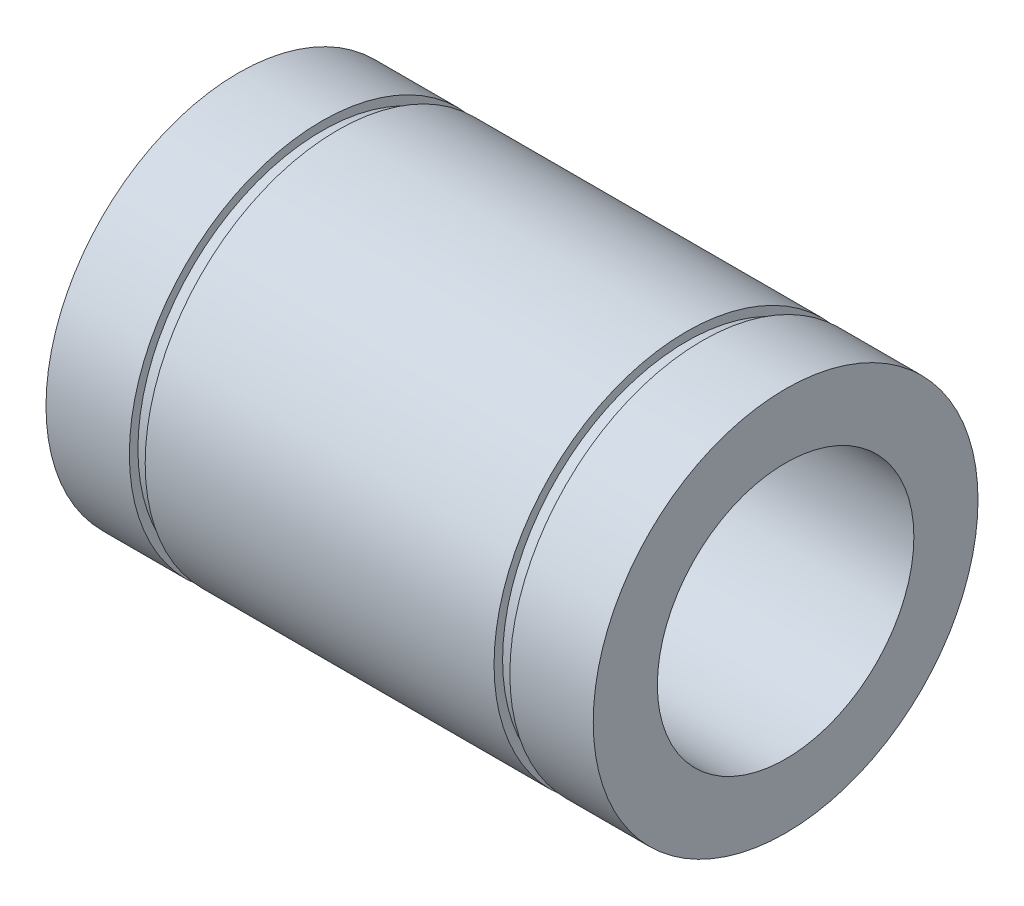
ISO-10303-21;
HEADER;
FILE_DESCRIPTION(('STEP AP214'),'2;1');
FILE_NAME('part.step','',(''),(''),'','','');
FILE_SCHEMA(('AUTOMOTIVE_DESIGN { 1 0 10303 214 1 1 1 1 }'));
ENDSEC;
DATA;
#1=APPLICATION_CONTEXT('core data for automotive mechanical design processes');
#2=APPLICATION_PROTOCOL_DEFINITION('international standard','automotive_design',2000,#1);
#3=PRODUCT_CONTEXT('',#1,'mechanical');
#4=PRODUCT('Part','Part','',(#3));
#5=PRODUCT_RELATED_PRODUCT_CATEGORY('part','',(#4));
#6=PRODUCT_DEFINITION_FORMATION('','',#4);
#7=PRODUCT_DEFINITION_CONTEXT('part definition',#1,'design');
#8=PRODUCT_DEFINITION('design','',#6,#7);
#9=PRODUCT_DEFINITION_SHAPE('','',#8);
#10=(LENGTH_UNIT() NAMED_UNIT(*) SI_UNIT(.MILLI.,.METRE.));
#11=(NAMED_UNIT(*) PLANE_ANGLE_UNIT() SI_UNIT($,.RADIAN.));
#12=(NAMED_UNIT(*) SI_UNIT($,.STERADIAN.) SOLID_ANGLE_UNIT());
#13=UNCERTAINTY_MEASURE_WITH_UNIT(LENGTH_MEASURE(1.E-05),#10,'distance_accuracy_value','');
#14=(GEOMETRIC_REPRESENTATION_CONTEXT(3) GLOBAL_UNCERTAINTY_ASSIGNED_CONTEXT((#13)) GLOBAL_UNIT_ASSIGNED_CONTEXT((#10,
#11,#12)) REPRESENTATION_CONTEXT('',''));
#15=CARTESIAN_POINT('',(0.,0.,0.));
#16=DIRECTION('',(0.,0.,1.));
#17=DIRECTION('',(1.,0.,0.));
#18=AXIS2_PLACEMENT_3D('',#15,#16,#17);
#19=CARTESIAN_POINT('',(32.,0.,0.));
#20=DIRECTION('',(-1.,0.,0.));
#21=DIRECTION('',(0.,0.,-1.));
#22=AXIS2_PLACEMENT_3D('',#19,#20,#21);
#23=CYLINDRICAL_SURFACE('',#22,22.5);
#24=CARTESIAN_POINT('',(-32.,0.,0.));
#25=DIRECTION('',(1.,0.,0.));
#26=DIRECTION('',(0.,0.,-1.));
#27=AXIS2_PLACEMENT_3D('',#24,#25,#26);
#28=CIRCLE('',#27,22.5);
#29=CARTESIAN_POINT('',(-32.,0.,-22.5));
#30=VERTEX_POINT('',#29);
#31=CARTESIAN_POINT('',(-32.,0.,22.5));
#32=VERTEX_POINT('',#31);
#33=EDGE_CURVE('E132',#30,#32,#28,.T.);
#34=ORIENTED_EDGE('',*,*,#33,.T.);
#35=DIRECTION('',(1.,0.,0.));
#36=VECTOR('',#35,1.);
#37=CARTESIAN_POINT('',(32.,0.,22.5));
#38=LINE('',#37,#36);
#39=CARTESIAN_POINT('',(-22.25,0.,22.5));
#40=VERTEX_POINT('',#39);
#41=EDGE_CURVE('E10',#32,#40,#38,.T.);
#42=ORIENTED_EDGE('',*,*,#41,.T.);
#43=CARTESIAN_POINT('',(-22.25,0.,0.));
#44=DIRECTION('',(1.,0.,0.));
#45=DIRECTION('',(0.,0.,-1.));
#46=AXIS2_PLACEMENT_3D('',#43,#44,#45);
#47=CIRCLE('',#46,22.5);
#48=CARTESIAN_POINT('',(-22.25,0.,-22.5));
#49=VERTEX_POINT('',#48);
#50=EDGE_CURVE('E228',#49,#40,#47,.T.);
#51=ORIENTED_EDGE('',*,*,#50,.F.);
#52=CARTESIAN_POINT('',(-22.25,0.,0.));
#53=DIRECTION('',(1.,0.,0.));
#54=DIRECTION('',(0.,0.,-1.));
#55=AXIS2_PLACEMENT_3D('',#52,#53,#54);
#56=CIRCLE('',#55,22.5);
#57=EDGE_CURVE('E24',#40,#49,#56,.T.);
#58=ORIENTED_EDGE('',*,*,#57,.F.);
#59=ORIENTED_EDGE('',*,*,#41,.F.);
#60=CARTESIAN_POINT('',(-32.,0.,0.));
#61=DIRECTION('',(1.,0.,0.));
#62=DIRECTION('',(0.,0.,-1.));
#63=AXIS2_PLACEMENT_3D('',#60,#61,#62);
#64=CIRCLE('',#63,22.5);
#65=EDGE_CURVE('E130',#32,#30,#64,.T.);
#66=ORIENTED_EDGE('',*,*,#65,.T.);
#67=EDGE_LOOP('',(#34,#42,#51,#58,#59,#66));
#68=FACE_BOUND('',#67,.T.);
#69=ADVANCED_FACE('F16',(#68),#23,.T.);
#70=CARTESIAN_POINT('',(-22.25,21.5,0.));
#71=DIRECTION('',(1.,0.,0.));
#72=DIRECTION('',(0.,1.,0.));
#73=AXIS2_PLACEMENT_3D('',#70,#71,#72);
#74=PLANE('',#73);
#75=CARTESIAN_POINT('',(-22.25,0.,0.));
#76=DIRECTION('',(1.,0.,0.));
#77=DIRECTION('',(0.,0.,-1.));
#78=AXIS2_PLACEMENT_3D('',#75,#76,#77);
#79=CIRCLE('',#78,21.5);
#80=CARTESIAN_POINT('',(-22.25,0.,-21.5));
#81=VERTEX_POINT('',#80);
#82=CARTESIAN_POINT('',(-22.25,0.,21.5));
#83=VERTEX_POINT('',#82);
#84=EDGE_CURVE('E173',#81,#83,#79,.T.);
#85=ORIENTED_EDGE('',*,*,#84,.F.);
#86=CARTESIAN_POINT('',(-22.25,0.,0.));
#87=DIRECTION('',(1.,0.,0.));
#88=DIRECTION('',(0.,0.,-1.));
#89=AXIS2_PLACEMENT_3D('',#86,#87,#88);
#90=CIRCLE('',#89,21.5);
#91=EDGE_CURVE('E225',#83,#81,#90,.T.);
#92=ORIENTED_EDGE('',*,*,#91,.F.);
#93=EDGE_LOOP('',(#85,#92));
#94=FACE_BOUND('',#93,.T.);
#95=ORIENTED_EDGE('',*,*,#50,.T.);
#96=ORIENTED_EDGE('',*,*,#57,.T.);
#97=EDGE_LOOP('',(#95,#96));
#98=FACE_BOUND('',#97,.T.);
#99=ADVANCED_FACE('F327',(#94,#98),#74,.T.);
#100=CARTESIAN_POINT('',(32.,0.,0.));
#101=DIRECTION('',(-1.,0.,0.));
#102=DIRECTION('',(0.,0.,-1.));
#103=AXIS2_PLACEMENT_3D('',#100,#101,#102);
#104=CYLINDRICAL_SURFACE('',#103,21.5);
#105=ORIENTED_EDGE('',*,*,#84,.T.);
#106=DIRECTION('',(1.,0.,0.));
#107=VECTOR('',#106,1.);
#108=CARTESIAN_POINT('',(32.,0.,21.5));
#109=LINE('',#108,#107);
#110=CARTESIAN_POINT('',(-20.4,0.,21.5));
#111=VERTEX_POINT('',#110);
#112=EDGE_CURVE('E222',#83,#111,#109,.T.);
#113=ORIENTED_EDGE('',*,*,#112,.T.);
#114=CARTESIAN_POINT('',(-20.4,0.,0.));
#115=DIRECTION('',(1.,0.,0.));
#116=DIRECTION('',(0.,0.,-1.));
#117=AXIS2_PLACEMENT_3D('',#114,#115,#116);
#118=CIRCLE('',#117,21.5);
#119=CARTESIAN_POINT('',(-20.4,0.,-21.5));
#120=VERTEX_POINT('',#119);
#121=EDGE_CURVE('E157',#120,#111,#118,.T.);
#122=ORIENTED_EDGE('',*,*,#121,.F.);
#123=CARTESIAN_POINT('',(-20.4,0.,0.));
#124=DIRECTION('',(1.,0.,0.));
#125=DIRECTION('',(0.,0.,-1.));
#126=AXIS2_PLACEMENT_3D('',#123,#124,#125);
#127=CIRCLE('',#126,21.5);
#128=EDGE_CURVE('E161',#111,#120,#127,.T.);
#129=ORIENTED_EDGE('',*,*,#128,.F.);
#130=ORIENTED_EDGE('',*,*,#112,.F.);
#131=ORIENTED_EDGE('',*,*,#91,.T.);
#132=EDGE_LOOP('',(#105,#113,#122,#129,#130,#131));
#133=FACE_BOUND('',#132,.T.);
#134=ADVANCED_FACE('F334',(#133),#104,.T.);
#135=CARTESIAN_POINT('',(-20.4,22.5,0.));
#136=DIRECTION('',(-1.,0.,0.));
#137=DIRECTION('',(0.,0.,1.));
#138=AXIS2_PLACEMENT_3D('',#135,#136,#137);
#139=PLANE('',#138);
#140=ORIENTED_EDGE('',*,*,#121,.T.);
#141=ORIENTED_EDGE('',*,*,#128,.T.);
#142=EDGE_LOOP('',(#140,#141));
#143=FACE_BOUND('',#142,.T.);
#144=CARTESIAN_POINT('',(-20.4,0.,0.));
#145=DIRECTION('',(1.,0.,0.));
#146=DIRECTION('',(0.,0.,-1.));
#147=AXIS2_PLACEMENT_3D('',#144,#145,#146);
#148=CIRCLE('',#147,22.5);
#149=CARTESIAN_POINT('',(-20.4,0.,-22.5));
#150=VERTEX_POINT('',#149);
#151=CARTESIAN_POINT('',(-20.4,0.,22.5));
#152=VERTEX_POINT('',#151);
#153=EDGE_CURVE('E210',#150,#152,#148,.T.);
#154=ORIENTED_EDGE('',*,*,#153,.F.);
#155=CARTESIAN_POINT('',(-20.4,0.,0.));
#156=DIRECTION('',(1.,0.,0.));
#157=DIRECTION('',(0.,0.,-1.));
#158=AXIS2_PLACEMENT_3D('',#155,#156,#157);
#159=CIRCLE('',#158,22.5);
#160=EDGE_CURVE('E162',#152,#150,#159,.T.);
#161=ORIENTED_EDGE('',*,*,#160,.F.);
#162=EDGE_LOOP('',(#154,#161));
#163=FACE_BOUND('',#162,.T.);
#164=ADVANCED_FACE('F344',(#143,#163),#139,.T.);
#165=CARTESIAN_POINT('',(32.,0.,0.));
#166=DIRECTION('',(-1.,0.,0.));
#167=DIRECTION('',(0.,0.,-1.));
#168=AXIS2_PLACEMENT_3D('',#165,#166,#167);
#169=CYLINDRICAL_SURFACE('',#168,22.5);
#170=ORIENTED_EDGE('',*,*,#153,.T.);
#171=DIRECTION('',(1.,0.,0.));
#172=VECTOR('',#171,1.);
#173=CARTESIAN_POINT('',(32.,0.,22.5));
#174=LINE('',#173,#172);
#175=CARTESIAN_POINT('',(20.4,0.,22.5));
#176=VERTEX_POINT('',#175);
#177=EDGE_CURVE('E214',#152,#176,#174,.T.);
#178=ORIENTED_EDGE('',*,*,#177,.T.);
#179=CARTESIAN_POINT('',(20.4,0.,0.));
#180=DIRECTION('',(1.,0.,0.));
#181=DIRECTION('',(0.,0.,-1.));
#182=AXIS2_PLACEMENT_3D('',#179,#180,#181);
#183=CIRCLE('',#182,22.5);
#184=CARTESIAN_POINT('',(20.4,0.,-22.5));
#185=VERTEX_POINT('',#184);
#186=EDGE_CURVE('E203',#185,#176,#183,.T.);
#187=ORIENTED_EDGE('',*,*,#186,.F.);
#188=CARTESIAN_POINT('',(20.4,0.,0.));
#189=DIRECTION('',(1.,0.,0.));
#190=DIRECTION('',(0.,0.,-1.));
#191=AXIS2_PLACEMENT_3D('',#188,#189,#190);
#192=CIRCLE('',#191,22.5);
#193=EDGE_CURVE('E207',#176,#185,#192,.T.);
#194=ORIENTED_EDGE('',*,*,#193,.F.);
#195=ORIENTED_EDGE('',*,*,#177,.F.);
#196=ORIENTED_EDGE('',*,*,#160,.T.);
#197=EDGE_LOOP('',(#170,#178,#187,#194,#195,#196));
#198=FACE_BOUND('',#197,.T.);
#199=ADVANCED_FACE('F339',(#198),#169,.T.);
#200=CARTESIAN_POINT('',(20.4,21.5,0.));
#201=DIRECTION('',(1.,0.,0.));
#202=DIRECTION('',(0.,1.,0.));
#203=AXIS2_PLACEMENT_3D('',#200,#201,#202);
#204=PLANE('',#203);
#205=CARTESIAN_POINT('',(20.4,0.,0.));
#206=DIRECTION('',(1.,0.,0.));
#207=DIRECTION('',(0.,0.,-1.));
#208=AXIS2_PLACEMENT_3D('',#205,#206,#207);
#209=CIRCLE('',#208,21.5);
#210=CARTESIAN_POINT('',(20.4,0.,-21.5));
#211=VERTEX_POINT('',#210);
#212=CARTESIAN_POINT('',(20.4,0.,21.5));
#213=VERTEX_POINT('',#212);
#214=EDGE_CURVE('E163',#211,#213,#209,.T.);
#215=ORIENTED_EDGE('',*,*,#214,.F.);
#216=CARTESIAN_POINT('',(20.4,0.,0.));
#217=DIRECTION('',(1.,0.,0.));
#218=DIRECTION('',(0.,0.,-1.));
#219=AXIS2_PLACEMENT_3D('',#216,#217,#218);
#220=CIRCLE('',#219,21.5);
#221=EDGE_CURVE('E176',#213,#211,#220,.T.);
#222=ORIENTED_EDGE('',*,*,#221,.F.);
#223=EDGE_LOOP('',(#215,#222));
#224=FACE_BOUND('',#223,.T.);
#225=ORIENTED_EDGE('',*,*,#186,.T.);
#226=ORIENTED_EDGE('',*,*,#193,.T.);
#227=EDGE_LOOP('',(#225,#226));
#228=FACE_BOUND('',#227,.T.);
#229=ADVANCED_FACE('F343',(#224,#228),#204,.T.);
#230=CARTESIAN_POINT('',(32.,0.,0.));
#231=DIRECTION('',(-1.,0.,0.));
#232=DIRECTION('',(0.,0.,-1.));
#233=AXIS2_PLACEMENT_3D('',#230,#231,#232);
#234=CYLINDRICAL_SURFACE('',#233,21.5);
#235=ORIENTED_EDGE('',*,*,#214,.T.);
#236=DIRECTION('',(1.,0.,0.));
#237=VECTOR('',#236,1.);
#238=CARTESIAN_POINT('',(32.,0.,21.5));
#239=LINE('',#238,#237);
#240=CARTESIAN_POINT('',(22.25,0.,21.5));
#241=VERTEX_POINT('',#240);
#242=EDGE_CURVE('E167',#213,#241,#239,.T.);
#243=ORIENTED_EDGE('',*,*,#242,.T.);
#244=CARTESIAN_POINT('',(22.25,0.,0.));
#245=DIRECTION('',(1.,0.,0.));
#246=DIRECTION('',(0.,0.,-1.));
#247=AXIS2_PLACEMENT_3D('',#244,#245,#246);
#248=CIRCLE('',#247,21.5);
#249=CARTESIAN_POINT('',(22.25,0.,-21.5));
#250=VERTEX_POINT('',#249);
#251=EDGE_CURVE('E195',#250,#241,#248,.T.);
#252=ORIENTED_EDGE('',*,*,#251,.F.);
#253=CARTESIAN_POINT('',(22.25,0.,0.));
#254=DIRECTION('',(1.,0.,0.));
#255=DIRECTION('',(0.,0.,-1.));
#256=AXIS2_PLACEMENT_3D('',#253,#254,#255);
#257=CIRCLE('',#256,21.5);
#258=EDGE_CURVE('E168',#241,#250,#257,.T.);
#259=ORIENTED_EDGE('',*,*,#258,.F.);
#260=ORIENTED_EDGE('',*,*,#242,.F.);
#261=ORIENTED_EDGE('',*,*,#221,.T.);
#262=EDGE_LOOP('',(#235,#243,#252,#259,#260,#261));
#263=FACE_BOUND('',#262,.T.);
#264=ADVANCED_FACE('F353',(#263),#234,.T.);
#265=CARTESIAN_POINT('',(22.25,22.5,0.));
#266=DIRECTION('',(-1.,0.,0.));
#267=DIRECTION('',(0.,0.,1.));
#268=AXIS2_PLACEMENT_3D('',#265,#266,#267);
#269=PLANE('',#268);
#270=ORIENTED_EDGE('',*,*,#251,.T.);
#271=ORIENTED_EDGE('',*,*,#258,.T.);
#272=EDGE_LOOP('',(#270,#271));
#273=FACE_BOUND('',#272,.T.);
#274=CARTESIAN_POINT('',(22.25,0.,0.));
#275=DIRECTION('',(1.,0.,0.));
#276=DIRECTION('',(0.,0.,-1.));
#277=AXIS2_PLACEMENT_3D('',#274,#275,#276);
#278=CIRCLE('',#277,22.5);
#279=CARTESIAN_POINT('',(22.25,0.,-22.5));
#280=VERTEX_POINT('',#279);
#281=CARTESIAN_POINT('',(22.25,0.,22.5));
#282=VERTEX_POINT('',#281);
#283=EDGE_CURVE('E187',#280,#282,#278,.T.);
#284=ORIENTED_EDGE('',*,*,#283,.F.);
#285=CARTESIAN_POINT('',(22.25,0.,0.));
#286=DIRECTION('',(1.,0.,0.));
#287=DIRECTION('',(0.,0.,-1.));
#288=AXIS2_PLACEMENT_3D('',#285,#286,#287);
#289=CIRCLE('',#288,22.5);
#290=EDGE_CURVE('E186',#282,#280,#289,.T.);
#291=ORIENTED_EDGE('',*,*,#290,.F.);
#292=EDGE_LOOP('',(#284,#291));
#293=FACE_BOUND('',#292,.T.);
#294=ADVANCED_FACE('F367',(#273,#293),#269,.T.);
#295=CARTESIAN_POINT('',(32.,0.,0.));
#296=DIRECTION('',(-1.,0.,0.));
#297=DIRECTION('',(0.,0.,-1.));
#298=AXIS2_PLACEMENT_3D('',#295,#296,#297);
#299=CYLINDRICAL_SURFACE('',#298,22.5);
#300=ORIENTED_EDGE('',*,*,#283,.T.);
#301=DIRECTION('',(1.,0.,0.));
#302=VECTOR('',#301,1.);
#303=CARTESIAN_POINT('',(32.,0.,22.5));
#304=LINE('',#303,#302);
#305=CARTESIAN_POINT('',(32.,0.,22.5));
#306=VERTEX_POINT('',#305);
#307=EDGE_CURVE('E183',#282,#306,#304,.T.);
#308=ORIENTED_EDGE('',*,*,#307,.T.);
#309=CARTESIAN_POINT('',(32.,0.,0.));
#310=DIRECTION('',(1.,0.,0.));
#311=DIRECTION('',(0.,0.,-1.));
#312=AXIS2_PLACEMENT_3D('',#309,#310,#311);
#313=CIRCLE('',#312,22.5);
#314=CARTESIAN_POINT('',(32.,0.,-22.5));
#315=VERTEX_POINT('',#314);
#316=EDGE_CURVE('E146',#315,#306,#313,.T.);
#317=ORIENTED_EDGE('',*,*,#316,.F.);
#318=CARTESIAN_POINT('',(32.,0.,0.));
#319=DIRECTION('',(1.,0.,0.));
#320=DIRECTION('',(0.,0.,-1.));
#321=AXIS2_PLACEMENT_3D('',#318,#319,#320);
#322=CIRCLE('',#321,22.5);
#323=EDGE_CURVE('E182',#306,#315,#322,.T.);
#324=ORIENTED_EDGE('',*,*,#323,.F.);
#325=ORIENTED_EDGE('',*,*,#307,.F.);
#326=ORIENTED_EDGE('',*,*,#290,.T.);
#327=EDGE_LOOP('',(#300,#308,#317,#324,#325,#326));
#328=FACE_BOUND('',#327,.T.);
#329=ADVANCED_FACE('F371',(#328),#299,.T.);
#330=CARTESIAN_POINT('',(32.,15.,0.));
#331=DIRECTION('',(1.,0.,0.));
#332=DIRECTION('',(0.,1.,0.));
#333=AXIS2_PLACEMENT_3D('',#330,#331,#332);
#334=PLANE('',#333);
#335=CARTESIAN_POINT('',(32.,0.,0.));
#336=DIRECTION('',(1.,0.,0.));
#337=DIRECTION('',(0.,0.,-1.));
#338=AXIS2_PLACEMENT_3D('',#335,#336,#337);
#339=CIRCLE('',#338,15.);
#340=CARTESIAN_POINT('',(32.,0.,-15.));
#341=VERTEX_POINT('',#340);
#342=CARTESIAN_POINT('',(32.,0.,15.));
#343=VERTEX_POINT('',#342);
#344=EDGE_CURVE('E149',#341,#343,#339,.T.);
#345=ORIENTED_EDGE('',*,*,#344,.F.);
#346=CARTESIAN_POINT('',(32.,0.,0.));
#347=DIRECTION('',(1.,0.,0.));
#348=DIRECTION('',(0.,0.,-1.));
#349=AXIS2_PLACEMENT_3D('',#346,#347,#348);
#350=CIRCLE('',#349,15.);
#351=EDGE_CURVE('E144',#343,#341,#350,.T.);
#352=ORIENTED_EDGE('',*,*,#351,.F.);
#353=EDGE_LOOP('',(#345,#352));
#354=FACE_BOUND('',#353,.T.);
#355=ORIENTED_EDGE('',*,*,#316,.T.);
#356=ORIENTED_EDGE('',*,*,#323,.T.);
#357=EDGE_LOOP('',(#355,#356));
#358=FACE_BOUND('',#357,.T.);
#359=ADVANCED_FACE('F380',(#354,#358),#334,.T.);
#360=CARTESIAN_POINT('',(32.,0.,0.));
#361=DIRECTION('',(-1.,0.,0.));
#362=DIRECTION('',(0.,0.,-1.));
#363=AXIS2_PLACEMENT_3D('',#360,#361,#362);
#364=CYLINDRICAL_SURFACE('',#363,15.);
#365=ORIENTED_EDGE('',*,*,#344,.T.);
#366=DIRECTION('',(-1.,0.,0.));
#367=VECTOR('',#366,1.);
#368=CARTESIAN_POINT('',(32.,0.,15.));
#369=LINE('',#368,#367);
#370=CARTESIAN_POINT('',(-32.,0.,15.));
#371=VERTEX_POINT('',#370);
#372=EDGE_CURVE('E147',#343,#371,#369,.T.);
#373=ORIENTED_EDGE('',*,*,#372,.T.);
#374=CARTESIAN_POINT('',(-32.,0.,0.));
#375=DIRECTION('',(1.,0.,0.));
#376=DIRECTION('',(0.,0.,-1.));
#377=AXIS2_PLACEMENT_3D('',#374,#375,#376);
#378=CIRCLE('',#377,15.);
#379=CARTESIAN_POINT('',(-32.,0.,-15.));
#380=VERTEX_POINT('',#379);
#381=EDGE_CURVE('E135',#380,#371,#378,.T.);
#382=ORIENTED_EDGE('',*,*,#381,.F.);
#383=CARTESIAN_POINT('',(-32.,0.,0.));
#384=DIRECTION('',(1.,0.,0.));
#385=DIRECTION('',(0.,0.,-1.));
#386=AXIS2_PLACEMENT_3D('',#383,#384,#385);
#387=CIRCLE('',#386,15.);
#388=EDGE_CURVE('E153',#371,#380,#387,.T.);
#389=ORIENTED_EDGE('',*,*,#388,.F.);
#390=ORIENTED_EDGE('',*,*,#372,.F.);
#391=ORIENTED_EDGE('',*,*,#351,.T.);
#392=EDGE_LOOP('',(#365,#373,#382,#389,#390,#391));
#393=FACE_BOUND('',#392,.T.);
#394=ADVANCED_FACE('F389',(#393),#364,.F.);
#395=CARTESIAN_POINT('',(-32.,22.5,0.));
#396=DIRECTION('',(-1.,0.,0.));
#397=DIRECTION('',(0.,0.,1.));
#398=AXIS2_PLACEMENT_3D('',#395,#396,#397);
#399=PLANE('',#398);
#400=ORIENTED_EDGE('',*,*,#381,.T.);
#401=ORIENTED_EDGE('',*,*,#388,.T.);
#402=EDGE_LOOP('',(#400,#401));
#403=FACE_BOUND('',#402,.T.);
#404=ORIENTED_EDGE('',*,*,#33,.F.);
#405=ORIENTED_EDGE('',*,*,#65,.F.);
#406=EDGE_LOOP('',(#404,#405));
#407=FACE_BOUND('',#406,.T.);
#408=ADVANCED_FACE('F137',(#403,#407),#399,.T.);
#409=CLOSED_SHELL('',(#69,#99,#134,#164,#199,#229,#264,#294,#329,#359,#394,#408));
#410=MANIFOLD_SOLID_BREP('B1',#409);
#411=ADVANCED_BREP_SHAPE_REPRESENTATION('',(#18,#410),#14);
#412=SHAPE_DEFINITION_REPRESENTATION(#9,#411);
ENDSEC;
END-ISO-10303-21;
